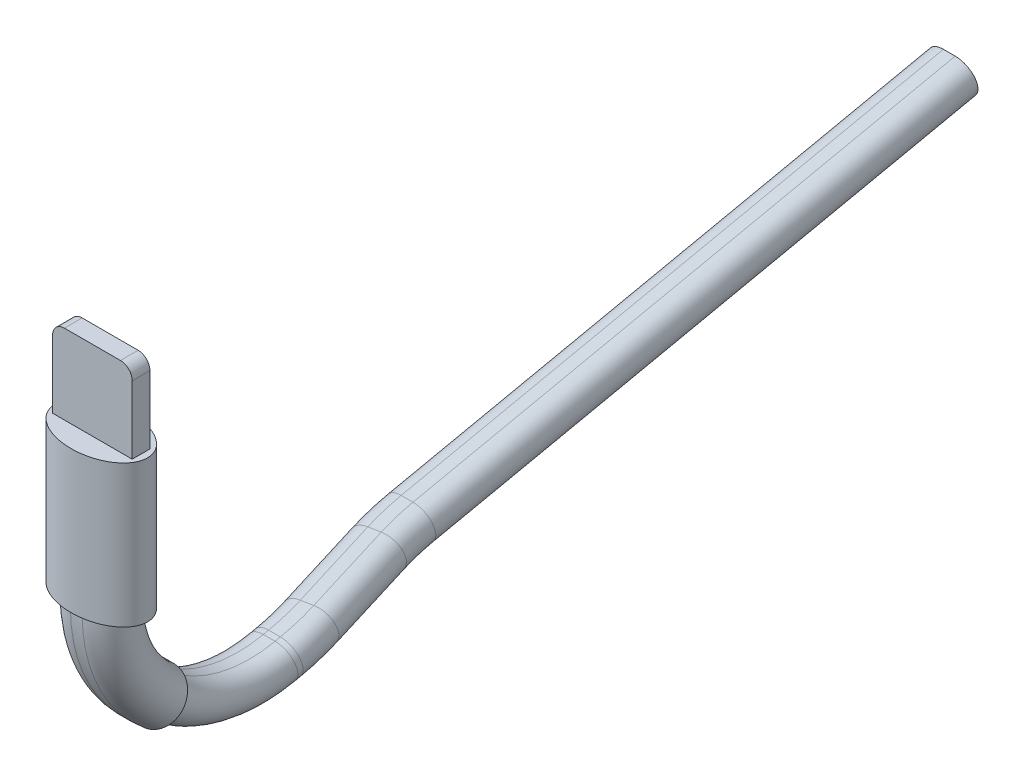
from build123d import *

# Parameters (mm, degrees)
SKETCH1_RX          = 3.925
SKETCH1_RY          = 2.5625
BOSS_EXTRUDE1_DEPTH = 12.05
SKETCH3_W           = 6.75
SKETCH3_H           = 1.5
BOSS_EXTRUDE3_DEPTH = 6.75
FILLET1_R           = 1


with BuildPart() as part:
    # Sketch1 → Boss-Extrude1 (new body)
    with BuildSketch(Plane(origin=(0, 0, 0), x_dir=(1, 0, 0), z_dir=(0, 1, 0))):
        with Locations((0, 0)):
            Ellipse(SKETCH1_RX, SKETCH1_RY)
    extrude(amount=BOSS_EXTRUDE1_DEPTH)

    # Sketch3 → Boss-Extrude3 (add)
    with BuildSketch(Plane(origin=(0, 12.05, 0), x_dir=(1, 0, 0), z_dir=(0, 1, 0))):
        Rectangle(SKETCH3_W, SKETCH3_H)
    extrude(amount=BOSS_EXTRUDE3_DEPTH)

    # Fillet1
    fillet1_edges = [part.edges().sort_by_distance(p)[0] for p in [
        (3.375, 18.8, 0),
        (-3.375, 18.8, 0),
    ]]
    fillet(fillet1_edges, radius=FILLET1_R)

    # Sweep1: sweep along a path in Sketch4
    with BuildLine(Plane(origin=(0, 0, 0), x_dir=(0, 0, -1), z_dir=(1, 0, 0))) as sweep1_path:
        ThreePointArc((0, 0), (4.469055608, -9.369569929), (14.563046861, -11.792922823))
    # Sketch2 → Sweep1 (sweep)
    with BuildSketch(Plane(origin=(0, 0, 0), x_dir=(1, 0, 0), z_dir=(0, 1, 0))):
        with BuildLine():
            Line((-0.5, 1.575), (0.5, 1.575))
            ThreePointArc((0.5, 1.575), (2.075, 0), (0.5, -1.575))
            Line((0.5, -1.575), (-0.5, -1.575))
            ThreePointArc((-0.5, -1.575), (-2.075, 0), (-0.5, 1.575))
        make_face()
    sweep(path=sweep1_path.line)

    # Sweep2: sweep along a path in Sketch5
    with BuildLine(Plane(origin=(0, 0, 0), x_dir=(0, 0, -1), z_dir=(1, 0, 0))) as sweep2_path:
        ThreePointArc((0, 0), (1.125118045, -5.085648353), (4.290477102, -9.222097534))
    # Sketch6 → Sweep2 (sweep)
    with BuildSketch(Plane.XZ):
        with BuildLine():
            Line((-0.5, 2.125), (0.5, 2.125))
            ThreePointArc((0.5, 2.125), (2.625, 0), (0.5, -2.125))
            Line((0.5, -2.125), (-0.5, -2.125))
            ThreePointArc((-0.5, -2.125), (-2.625, 0), (-0.5, 2.125))
        make_face()
    sweep(path=sweep2_path.line)

    # Sweep3: sweep along a curve in space
    with BuildLine() as sweep3_path:
        Line((0, -11.792922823, -14.563046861), (0, -11.697449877, -15.012211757))
        ThreePointArc((0, -11.697449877, -15.012211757), (-0.059088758, -11.378045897, -16.51488934), (-0.236005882, -11.060529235, -18.008687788))
        Line((-0.236005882, -11.060529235, -18.008687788), (-1.313994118, -9.61455274, -24.811472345))
        ThreePointArc((-1.313994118, -9.61455274, -24.811472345), (-1.490911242, -9.297036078, -26.305270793), (-1.55, -8.977632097, -27.807948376))
        Line((-1.55, -8.977632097, -27.807948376), (-1.55, 0.79489909, -73.784092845))
    # Sketch9 → Sweep3 (sweep)
    with BuildSketch(Plane(origin=(0, 2.451886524, -11.535219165), x_dir=(-1, 0, 0), z_dir=(0, 0.20791169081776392, -0.9781476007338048))):
        with BuildLine():
            Line((0.5, -12.988046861), (-0.5, -12.988046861))
            ThreePointArc((-0.5, -12.988046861), (-2.075, -14.563046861), (-0.5, -16.138046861))
            Line((-0.5, -16.138046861), (0.5, -16.138046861))
            ThreePointArc((0.5, -16.138046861), (2.075, -14.563046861), (0.5, -12.988046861))
        make_face()
    sweep(path=sweep3_path.line)


solid = part.part
